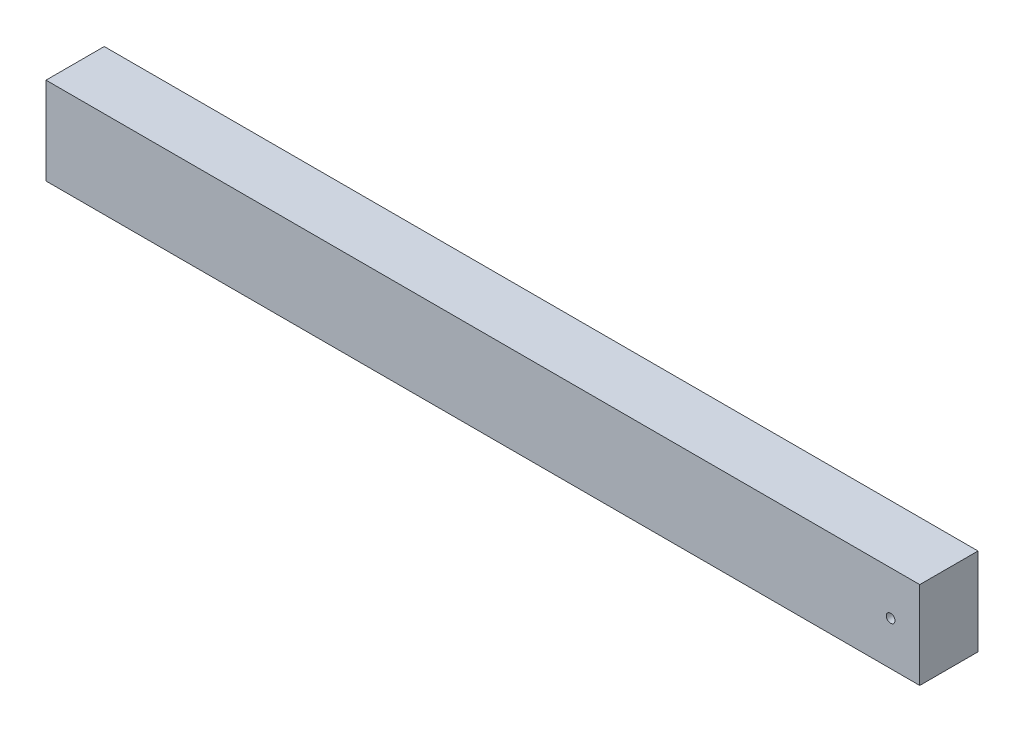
from build123d import *

# Parameters (mm, degrees)
ESQUISSE1_W        = 600
ESQUISSE1_H        = 60
ESQUISSE1_R        = 3
BOSS_EXTRU_1_DEPTH = 20


with BuildPart() as part:
    # Esquisse1 → Boss.-Extru.1 (new, symmetric)
    with BuildSketch(Plane.XY):
        Rectangle(ESQUISSE1_W, ESQUISSE1_H)
        with Locations((280, 0)):
            Circle(ESQUISSE1_R, mode=Mode.SUBTRACT)
    extrude(amount=BOSS_EXTRU_1_DEPTH, both=True)


solid = part.part
